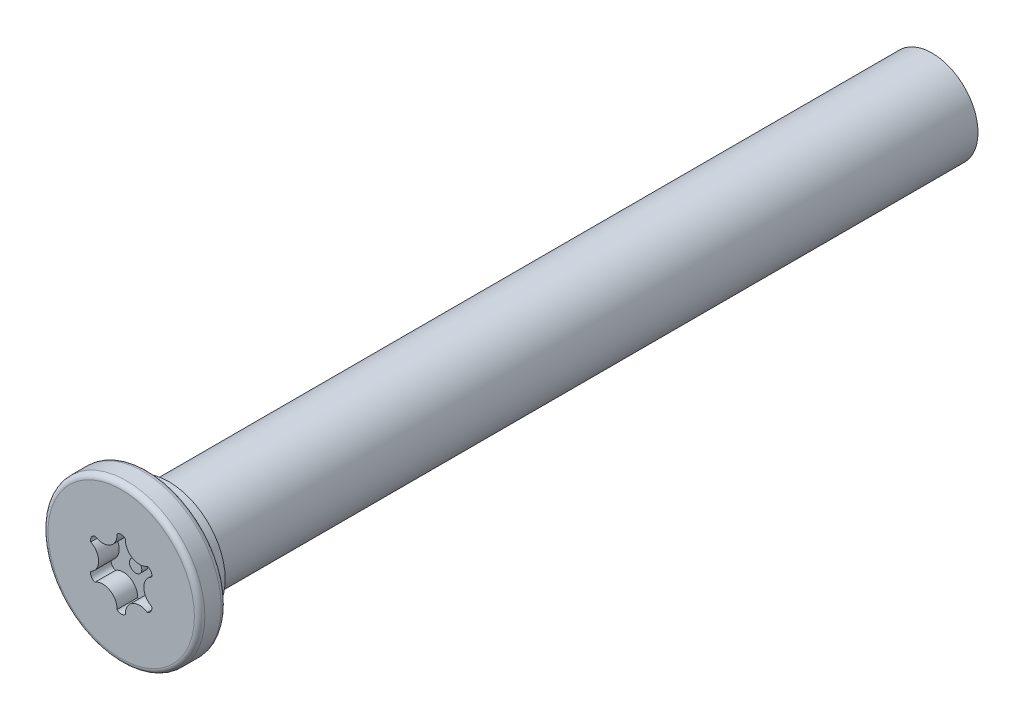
from build123d import *

# Parameters (mm, degrees)
SKETCH2_W           = 1.3
SKETCH2_H           = 3.81
SKETCH2_W_2         = 12.7
SKETCH2_H_2         = 2.23
CUT_EXTRUDE3_DEPTH  = 1
FILLET12_R          = 0.254
CUT_EXTRUDE6_START  = -12.7
SKETCH7_R           = 2.23
CUT_EXTRUDE6_DEPTH  = 12.7
SKETCH11_R          = 2.738000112
SKETCH11_R_2        = 2.230000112
BOSS_EXTRUDE1_DEPTH = 1.016
SKETCH12_R          = 2.230000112
BOSS_EXTRUDE2_DEPTH = 12.7
SKETCH14_R          = 0.3
BOSS_EXTRUDE4_DEPTH = 0.3
CUT_EXTRUDE7_START  = -12.7
SKETCH15_R          = 2.230000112
CUT_EXTRUDE7_DEPTH  = 12.7
SKETCH16_R          = 2.230000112
BOSS_EXTRUDE5_DEPTH = 38.1


with BuildPart() as part:
    # Sketch2 → Revolve1 (revolve)
    with BuildSketch(Plane(origin=(0, 0, 0), x_dir=(0, 0, -1), z_dir=(1, 0, 0)), mode=Mode.PRIVATE) as revolve1_sk:
        with Locations((0.65, 1.905)):
            Rectangle(SKETCH2_W, SKETCH2_H)
        with Locations((7.65, 1.115)):
            Rectangle(SKETCH2_W_2, SKETCH2_H_2)
    revolve(revolve1_sk.sketch.rotate(Axis((0, 0, -1.3), (0, 0, -1)), 90), axis=Axis((0, 0, -1.3), (0, 0, -1)))

    # Sketch3 → Cut-Extrude3 (cut)
    with BuildSketch(Plane.XY):
        with BuildLine():
            ThreePointArc((-0.205060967, 1.589373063), (0, 1.674312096), (0.205060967, 1.589373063))
            ThreePointArc((0.205060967, 1.589373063), (0.54882888, 0.950599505), (1.273906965, 0.972274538))
            ThreePointArc((1.273906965, 0.972274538), (1.449996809, 0.837156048), (1.478967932, 0.617098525))
            ThreePointArc((1.478967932, 0.617098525), (1.097657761, 0), (1.478967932, -0.617098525))
            ThreePointArc((1.478967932, -0.617098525), (1.449996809, -0.837156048), (1.273906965, -0.972274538))
            ThreePointArc((1.273906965, -0.972274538), (0.54882888, -0.950599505), (0.205060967, -1.589373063))
            ThreePointArc((0.205060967, -1.589373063), (0, -1.674312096), (-0.205060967, -1.589373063))
            ThreePointArc((-0.205060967, -1.589373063), (-0.54882888, -0.950599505), (-1.273906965, -0.972274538))
            ThreePointArc((-1.273906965, -0.972274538), (-1.449996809, -0.837156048), (-1.478967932, -0.617098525))
            ThreePointArc((-1.478967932, -0.617098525), (-1.097657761, 0), (-1.478967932, 0.617098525))
            ThreePointArc((-1.478967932, 0.617098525), (-1.449996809, 0.837156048), (-1.273906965, 0.972274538))
            ThreePointArc((-1.273906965, 0.972274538), (-0.54882888, 0.950599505), (-0.205060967, 1.589373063))
        make_face()
    extrude(amount=-CUT_EXTRUDE3_DEPTH, mode=Mode.SUBTRACT)

    # Fillet12
    fillet12_edges = [part.edges().sort_by_distance(p)[0] for p in [
        (-3.81, 0, 0),
        (-3.81, 0, -1.3),
    ]]
    fillet(fillet12_edges, radius=FILLET12_R)

    # Sketch7 → Cut-Extrude6 (cut)
    with BuildSketch(Plane(origin=(0, 0, -14), x_dir=(-1, 0, 0), z_dir=(0, 0, -1)).offset(CUT_EXTRUDE6_START)):
        Circle(SKETCH7_R)
    extrude(amount=CUT_EXTRUDE6_DEPTH, mode=Mode.SUBTRACT)

    # Sketch11 → Boss-Extrude1 (add)
    with BuildSketch(Plane(origin=(0, 0, -1.3), x_dir=(-1, 0, 0), z_dir=(0, 0, -1))):
        with Locations(Location((0, 0, 0), (0, 0, 180))):
            Circle(SKETCH11_R)
        Circle(SKETCH11_R_2, mode=Mode.SUBTRACT)
    extrude(amount=BOSS_EXTRUDE1_DEPTH)

    # Sketch12 → Boss-Extrude2 (add)
    with BuildSketch(Plane(origin=(0, 0, -1.3), x_dir=(-1, 0, 0), z_dir=(0, 0, -1))):
        Circle(SKETCH12_R)
    extrude(amount=BOSS_EXTRUDE2_DEPTH)

    # Sketch14 → Boss-Extrude4 (add)
    with BuildSketch(Plane.XY.offset(-1)):
        Circle(SKETCH14_R)
    extrude(amount=BOSS_EXTRUDE4_DEPTH)

    # Sketch15 → Cut-Extrude7 (cut)
    with BuildSketch(Plane(origin=(0, 0, -14), x_dir=(-1, 0, 0), z_dir=(0, 0, -1)).offset(CUT_EXTRUDE7_START)):
        Circle(SKETCH15_R)
    extrude(amount=CUT_EXTRUDE7_DEPTH, mode=Mode.SUBTRACT)

    # Sketch16 → Boss-Extrude5 (add)
    with BuildSketch(Plane(origin=(0, 0, -1.3), x_dir=(-1, 0, 0), z_dir=(0, 0, -1))):
        with Locations(Location((0, 0, 0), (0, 0, 180))):
            Circle(SKETCH16_R)
    extrude(amount=BOSS_EXTRUDE5_DEPTH)


solid = part.part
